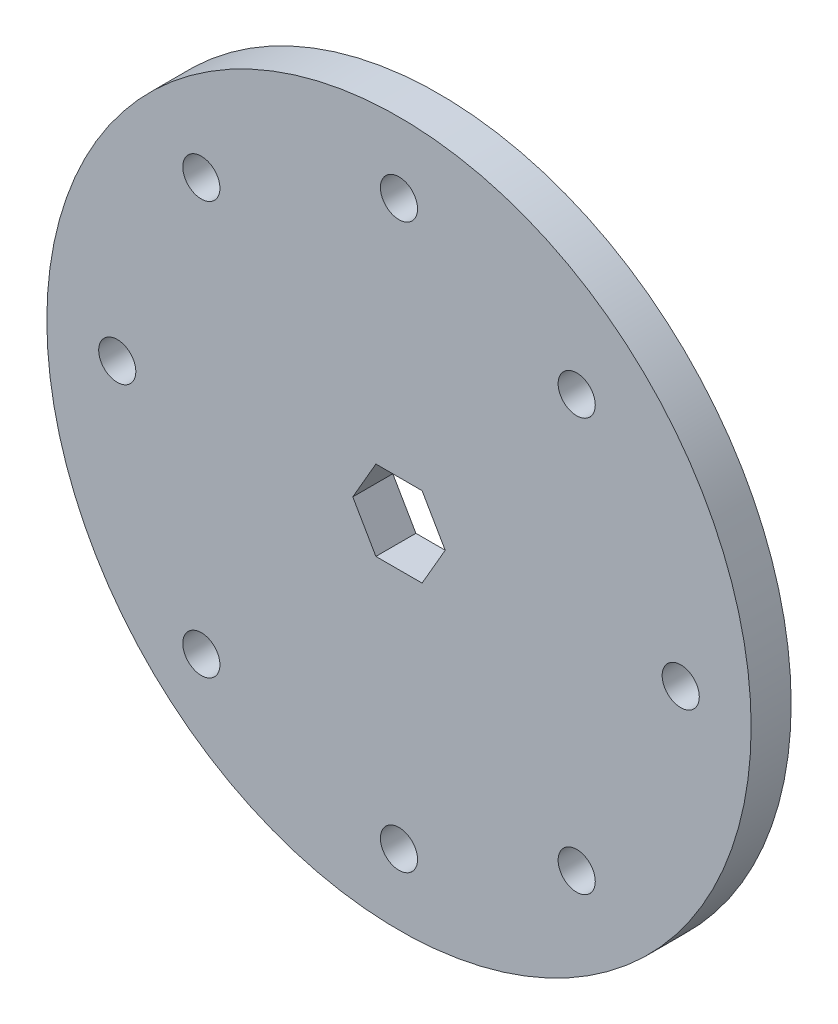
from build123d import *

# Parameters (mm, degrees)
SKETCH2_R             = 27.94
BOSS_EXTRUDE1_DEPTH   = 3.175
CUT_EXTRUDE2_DEPTH    = 40.640482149
F_4_CLEARANCE_HOLE1_D = 2.9464


with BuildPart() as part:
    # Sketch2 → Boss-Extrude1 (new body)
    with BuildSketch(Plane.XY):
        Circle(SKETCH2_R)
    extrude(amount=BOSS_EXTRUDE1_DEPTH)

    # Sketch5 → Cut-Extrude2 (cut, through all)
    with BuildSketch(Plane.XY.offset(3.175)):
        Polygon((3.666174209, 0), (1.833087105, 3.175), (-1.833087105, 3.175), (-3.666174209, 0), (-1.833087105, -3.175), (1.833087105, -3.175), align=None)
    extrude(amount=-CUT_EXTRUDE2_DEPTH, mode=Mode.SUBTRACT)

    # 4 Clearance Hole1 (through all)
    with Locations(Plane.XY.offset(3.175)):
        with Locations((-22.352, 0), (22.352, 0), (0, 22.352), (0, -22.352), (14.098917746, 15.929116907), (-15.680406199, 15.929116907), (-15.680406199, -16.809073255), (14.098917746, -16.809073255)):
            Hole(F_4_CLEARANCE_HOLE1_D / 2)


solid = part.part
